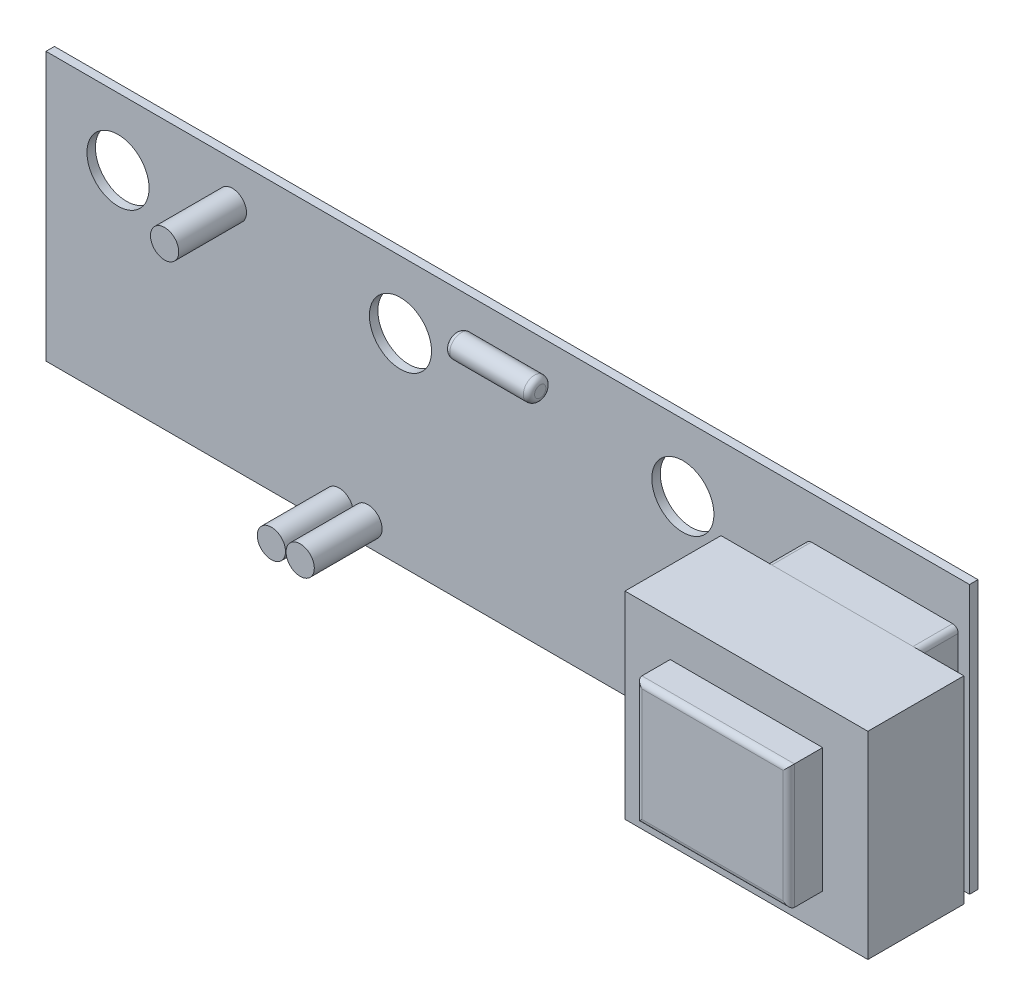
ISO-10303-21;
HEADER;
FILE_DESCRIPTION(('STEP AP214'),'2;1');
FILE_NAME('part.step','',(''),(''),'','','');
FILE_SCHEMA(('AUTOMOTIVE_DESIGN { 1 0 10303 214 1 1 1 1 }'));
ENDSEC;
DATA;
#1=APPLICATION_CONTEXT('core data for automotive mechanical design processes');
#2=APPLICATION_PROTOCOL_DEFINITION('international standard','automotive_design',2000,#1);
#3=PRODUCT_CONTEXT('',#1,'mechanical');
#4=PRODUCT('Part','Part','',(#3));
#5=PRODUCT_RELATED_PRODUCT_CATEGORY('part','',(#4));
#6=PRODUCT_DEFINITION_FORMATION('','',#4);
#7=PRODUCT_DEFINITION_CONTEXT('part definition',#1,'design');
#8=PRODUCT_DEFINITION('design','',#6,#7);
#9=PRODUCT_DEFINITION_SHAPE('','',#8);
#10=(LENGTH_UNIT() NAMED_UNIT(*) SI_UNIT(.MILLI.,.METRE.));
#11=(NAMED_UNIT(*) PLANE_ANGLE_UNIT() SI_UNIT($,.RADIAN.));
#12=(NAMED_UNIT(*) SI_UNIT($,.STERADIAN.) SOLID_ANGLE_UNIT());
#13=UNCERTAINTY_MEASURE_WITH_UNIT(LENGTH_MEASURE(1.E-05),#10,'distance_accuracy_value','');
#14=(GEOMETRIC_REPRESENTATION_CONTEXT(3) GLOBAL_UNCERTAINTY_ASSIGNED_CONTEXT((#13)) GLOBAL_UNIT_ASSIGNED_CONTEXT((#10,
#11,#12)) REPRESENTATION_CONTEXT('',''));
#15=CARTESIAN_POINT('',(0.,0.,0.));
#16=DIRECTION('',(0.,0.,1.));
#17=DIRECTION('',(1.,0.,0.));
#18=AXIS2_PLACEMENT_3D('',#15,#16,#17);
#19=CARTESIAN_POINT('',(70.,-5.75015964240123,3.));
#20=DIRECTION('',(-1.,0.,0.));
#21=DIRECTION('',(0.,0.,1.));
#22=AXIS2_PLACEMENT_3D('',#19,#20,#21);
#23=CYLINDRICAL_SURFACE('',#22,1.5);
#24=CARTESIAN_POINT('',(60.4,-5.75015964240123,3.));
#25=DIRECTION('',(1.,0.,0.));
#26=DIRECTION('',(0.,0.,-1.));
#27=AXIS2_PLACEMENT_3D('',#24,#25,#26);
#28=CIRCLE('',#27,1.5);
#29=CARTESIAN_POINT('',(60.4,-5.75015964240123,1.5));
#30=VERTEX_POINT('',#29);
#31=EDGE_CURVE('E50',#30,#30,#28,.T.);
#32=ORIENTED_EDGE('',*,*,#31,.T.);
#33=EDGE_LOOP('',(#32));
#34=FACE_BOUND('',#33,.T.);
#35=CARTESIAN_POINT('',(69.6,-5.75015964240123,3.));
#36=DIRECTION('',(1.,0.,0.));
#37=DIRECTION('',(0.,0.,-1.));
#38=AXIS2_PLACEMENT_3D('',#35,#36,#37);
#39=CIRCLE('',#38,1.5);
#40=CARTESIAN_POINT('',(69.6,-5.75015964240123,1.5));
#41=VERTEX_POINT('',#40);
#42=EDGE_CURVE('E54',#41,#41,#39,.F.);
#43=ORIENTED_EDGE('',*,*,#42,.T.);
#44=EDGE_LOOP('',(#43));
#45=FACE_BOUND('',#44,.T.);
#46=ADVANCED_FACE('F40',(#34,#45),#23,.T.);
#47=CARTESIAN_POINT('',(70.,-5.75015964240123,3.));
#48=DIRECTION('',(1.,0.,0.));
#49=DIRECTION('',(0.,0.,-1.));
#50=AXIS2_PLACEMENT_3D('',#47,#48,#49);
#51=PLANE('',#50);
#52=CARTESIAN_POINT('',(70.,-5.75015964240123,3.));
#53=DIRECTION('',(1.,0.,0.));
#54=DIRECTION('',(0.,0.,-1.));
#55=AXIS2_PLACEMENT_3D('',#52,#53,#54);
#56=CIRCLE('',#55,1.1);
#57=CARTESIAN_POINT('',(70.,-5.75015964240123,1.9));
#58=VERTEX_POINT('',#57);
#59=EDGE_CURVE('E11',#58,#58,#56,.T.);
#60=ORIENTED_EDGE('',*,*,#59,.T.);
#61=EDGE_LOOP('',(#60));
#62=FACE_BOUND('',#61,.T.);
#63=ADVANCED_FACE('F73',(#62),#51,.T.);
#64=CARTESIAN_POINT('',(60.,-5.75015964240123,3.));
#65=DIRECTION('',(1.,0.,0.));
#66=DIRECTION('',(0.,0.,-1.));
#67=AXIS2_PLACEMENT_3D('',#64,#65,#66);
#68=PLANE('',#67);
#69=CARTESIAN_POINT('',(60.,-5.75015964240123,3.));
#70=DIRECTION('',(1.,0.,0.));
#71=DIRECTION('',(0.,0.,-1.));
#72=AXIS2_PLACEMENT_3D('',#69,#70,#71);
#73=CIRCLE('',#72,1.1);
#74=CARTESIAN_POINT('',(60.,-5.75015964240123,1.9));
#75=VERTEX_POINT('',#74);
#76=EDGE_CURVE('E46',#75,#75,#73,.F.);
#77=ORIENTED_EDGE('',*,*,#76,.T.);
#78=EDGE_LOOP('',(#77));
#79=FACE_BOUND('',#78,.T.);
#80=ADVANCED_FACE('F69',(#79),#68,.F.);
#81=CARTESIAN_POINT('',(60.4,-5.75015964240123,3.));
#82=DIRECTION('',(1.,0.,0.));
#83=DIRECTION('',(0.,0.,-1.));
#84=AXIS2_PLACEMENT_3D('',#81,#82,#83);
#85=TOROIDAL_SURFACE('',#84,1.1,0.4);
#86=ORIENTED_EDGE('',*,*,#76,.F.);
#87=EDGE_LOOP('',(#86));
#88=FACE_BOUND('',#87,.T.);
#89=ORIENTED_EDGE('',*,*,#31,.F.);
#90=EDGE_LOOP('',(#89));
#91=FACE_BOUND('',#90,.T.);
#92=ADVANCED_FACE('F64',(#88,#91),#85,.T.);
#93=CARTESIAN_POINT('',(69.6,-5.75015964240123,3.));
#94=DIRECTION('',(1.,0.,0.));
#95=DIRECTION('',(0.,0.,-1.));
#96=AXIS2_PLACEMENT_3D('',#93,#94,#95);
#97=TOROIDAL_SURFACE('',#96,1.1,0.4);
#98=ORIENTED_EDGE('',*,*,#42,.F.);
#99=EDGE_LOOP('',(#98));
#100=FACE_BOUND('',#99,.T.);
#101=ORIENTED_EDGE('',*,*,#59,.F.);
#102=EDGE_LOOP('',(#101));
#103=FACE_BOUND('',#102,.T.);
#104=ADVANCED_FACE('F61',(#100,#103),#97,.T.);
#105=CLOSED_SHELL('',(#46,#63,#80,#92,#104));
#106=MANIFOLD_SOLID_BREP('B2',#105);
#107=CARTESIAN_POINT('',(35.,27.6151021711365,3.5));
#108=DIRECTION('',(-1.,0.,0.));
#109=DIRECTION('',(0.,0.,1.));
#110=AXIS2_PLACEMENT_3D('',#107,#108,#109);
#111=CYLINDRICAL_SURFACE('',#110,2.);
#112=CARTESIAN_POINT('',(21.,27.6151021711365,3.5));
#113=DIRECTION('',(1.,0.,0.));
#114=DIRECTION('',(0.,0.,-1.));
#115=AXIS2_PLACEMENT_3D('',#112,#113,#114);
#116=CIRCLE('',#115,2.);
#117=CARTESIAN_POINT('',(21.,27.6151021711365,1.5));
#118=VERTEX_POINT('',#117);
#119=EDGE_CURVE('E119',#118,#118,#116,.T.);
#120=ORIENTED_EDGE('',*,*,#119,.T.);
#121=EDGE_LOOP('',(#120));
#122=FACE_BOUND('',#121,.T.);
#123=CARTESIAN_POINT('',(34.,27.6151021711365,3.5));
#124=DIRECTION('',(1.,0.,0.));
#125=DIRECTION('',(0.,0.,-1.));
#126=AXIS2_PLACEMENT_3D('',#123,#124,#125);
#127=CIRCLE('',#126,2.);
#128=CARTESIAN_POINT('',(34.,27.6151021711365,1.5));
#129=VERTEX_POINT('',#128);
#130=EDGE_CURVE('E123',#129,#129,#127,.F.);
#131=ORIENTED_EDGE('',*,*,#130,.T.);
#132=EDGE_LOOP('',(#131));
#133=FACE_BOUND('',#132,.T.);
#134=ADVANCED_FACE('F109',(#122,#133),#111,.T.);
#135=CARTESIAN_POINT('',(35.,27.6151021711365,3.5));
#136=DIRECTION('',(1.,0.,0.));
#137=DIRECTION('',(0.,0.,-1.));
#138=AXIS2_PLACEMENT_3D('',#135,#136,#137);
#139=PLANE('',#138);
#140=CARTESIAN_POINT('',(35.,27.6151021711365,3.5));
#141=DIRECTION('',(1.,0.,0.));
#142=DIRECTION('',(0.,0.,-1.));
#143=AXIS2_PLACEMENT_3D('',#140,#141,#142);
#144=CIRCLE('',#143,1.);
#145=CARTESIAN_POINT('',(35.,27.6151021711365,2.5));
#146=VERTEX_POINT('',#145);
#147=EDGE_CURVE('E39',#146,#146,#144,.T.);
#148=ORIENTED_EDGE('',*,*,#147,.T.);
#149=EDGE_LOOP('',(#148));
#150=FACE_BOUND('',#149,.T.);
#151=ADVANCED_FACE('F142',(#150),#139,.T.);
#152=CARTESIAN_POINT('',(20.,27.6151021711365,3.5));
#153=DIRECTION('',(1.,0.,0.));
#154=DIRECTION('',(0.,0.,-1.));
#155=AXIS2_PLACEMENT_3D('',#152,#153,#154);
#156=PLANE('',#155);
#157=CARTESIAN_POINT('',(20.,27.6151021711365,3.5));
#158=DIRECTION('',(1.,0.,0.));
#159=DIRECTION('',(0.,0.,-1.));
#160=AXIS2_PLACEMENT_3D('',#157,#158,#159);
#161=CIRCLE('',#160,1.);
#162=CARTESIAN_POINT('',(20.,27.6151021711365,2.5));
#163=VERTEX_POINT('',#162);
#164=EDGE_CURVE('E115',#163,#163,#161,.F.);
#165=ORIENTED_EDGE('',*,*,#164,.T.);
#166=EDGE_LOOP('',(#165));
#167=FACE_BOUND('',#166,.T.);
#168=ADVANCED_FACE('F138',(#167),#156,.F.);
#169=CARTESIAN_POINT('',(21.,27.6151021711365,3.5));
#170=DIRECTION('',(1.,0.,0.));
#171=DIRECTION('',(0.,0.,-1.));
#172=AXIS2_PLACEMENT_3D('',#169,#170,#171);
#173=TOROIDAL_SURFACE('',#172,1.,1.);
#174=ORIENTED_EDGE('',*,*,#164,.F.);
#175=EDGE_LOOP('',(#174));
#176=FACE_BOUND('',#175,.T.);
#177=ORIENTED_EDGE('',*,*,#119,.F.);
#178=EDGE_LOOP('',(#177));
#179=FACE_BOUND('',#178,.T.);
#180=ADVANCED_FACE('F133',(#176,#179),#173,.T.);
#181=CARTESIAN_POINT('',(34.,27.6151021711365,3.5));
#182=DIRECTION('',(1.,0.,0.));
#183=DIRECTION('',(0.,0.,-1.));
#184=AXIS2_PLACEMENT_3D('',#181,#182,#183);
#185=TOROIDAL_SURFACE('',#184,1.,1.);
#186=ORIENTED_EDGE('',*,*,#130,.F.);
#187=EDGE_LOOP('',(#186));
#188=FACE_BOUND('',#187,.T.);
#189=ORIENTED_EDGE('',*,*,#147,.F.);
#190=EDGE_LOOP('',(#189));
#191=FACE_BOUND('',#190,.T.);
#192=ADVANCED_FACE('F130',(#188,#191),#185,.T.);
#193=CLOSED_SHELL('',(#134,#151,#168,#180,#192));
#194=MANIFOLD_SOLID_BREP('B6',#193);
#195=CARTESIAN_POINT('',(-21.5,27.,13.5));
#196=DIRECTION('',(0.,0.,-1.));
#197=DIRECTION('',(-1.,0.,0.));
#198=AXIS2_PLACEMENT_3D('',#195,#196,#197);
#199=CYLINDRICAL_SURFACE('',#198,2.5);
#200=CARTESIAN_POINT('',(-21.5,27.,13.5));
#201=DIRECTION('',(0.,0.,1.));
#202=DIRECTION('',(1.,0.,0.));
#203=AXIS2_PLACEMENT_3D('',#200,#201,#202);
#204=CIRCLE('',#203,2.5);
#205=CARTESIAN_POINT('',(-19.,27.,13.5));
#206=VERTEX_POINT('',#205);
#207=EDGE_CURVE('E108',#206,#206,#204,.T.);
#208=ORIENTED_EDGE('',*,*,#207,.F.);
#209=EDGE_LOOP('',(#208));
#210=FACE_BOUND('',#209,.T.);
#211=CARTESIAN_POINT('',(-21.5,27.,1.5));
#212=DIRECTION('',(0.,0.,1.));
#213=DIRECTION('',(1.,0.,0.));
#214=AXIS2_PLACEMENT_3D('',#211,#212,#213);
#215=CIRCLE('',#214,2.5);
#216=CARTESIAN_POINT('',(-19.,27.,1.5));
#217=VERTEX_POINT('',#216);
#218=EDGE_CURVE('E184',#217,#217,#215,.T.);
#219=ORIENTED_EDGE('',*,*,#218,.T.);
#220=EDGE_LOOP('',(#219));
#221=FACE_BOUND('',#220,.T.);
#222=ADVANCED_FACE('F178',(#210,#221),#199,.T.);
#223=CARTESIAN_POINT('',(-21.5,27.,13.5));
#224=DIRECTION('',(0.,0.,1.));
#225=DIRECTION('',(1.,0.,0.));
#226=AXIS2_PLACEMENT_3D('',#223,#224,#225);
#227=PLANE('',#226);
#228=ORIENTED_EDGE('',*,*,#207,.T.);
#229=EDGE_LOOP('',(#228));
#230=FACE_BOUND('',#229,.T.);
#231=ADVANCED_FACE('F193',(#230),#227,.T.);
#232=CARTESIAN_POINT('',(-21.5,27.,1.5));
#233=DIRECTION('',(0.,0.,1.));
#234=DIRECTION('',(1.,0.,0.));
#235=AXIS2_PLACEMENT_3D('',#232,#233,#234);
#236=PLANE('',#235);
#237=ORIENTED_EDGE('',*,*,#218,.F.);
#238=EDGE_LOOP('',(#237));
#239=FACE_BOUND('',#238,.T.);
#240=ADVANCED_FACE('F191',(#239),#236,.F.);
#241=CLOSED_SHELL('',(#222,#231,#240));
#242=MANIFOLD_SOLID_BREP('B34',#241);
#243=CARTESIAN_POINT('',(2.49999999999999,-9.49999999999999,13.5));
#244=DIRECTION('',(0.,0.,-1.));
#245=DIRECTION('',(-1.,0.,0.));
#246=AXIS2_PLACEMENT_3D('',#243,#244,#245);
#247=CYLINDRICAL_SURFACE('',#246,2.5);
#248=CARTESIAN_POINT('',(2.49999999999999,-9.49999999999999,13.5));
#249=DIRECTION('',(0.,0.,1.));
#250=DIRECTION('',(1.,0.,0.));
#251=AXIS2_PLACEMENT_3D('',#248,#249,#250);
#252=CIRCLE('',#251,2.5);
#253=CARTESIAN_POINT('',(4.99999999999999,-9.49999999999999,13.5));
#254=VERTEX_POINT('',#253);
#255=EDGE_CURVE('E177',#254,#254,#252,.T.);
#256=ORIENTED_EDGE('',*,*,#255,.F.);
#257=EDGE_LOOP('',(#256));
#258=FACE_BOUND('',#257,.T.);
#259=CARTESIAN_POINT('',(2.49999999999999,-9.5,1.50000000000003));
#260=DIRECTION('',(0.,0.,1.));
#261=DIRECTION('',(1.,0.,0.));
#262=AXIS2_PLACEMENT_3D('',#259,#260,#261);
#263=CIRCLE('',#262,2.5);
#264=CARTESIAN_POINT('',(4.99999999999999,-9.5,1.50000000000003));
#265=VERTEX_POINT('',#264);
#266=EDGE_CURVE('E227',#265,#265,#263,.T.);
#267=ORIENTED_EDGE('',*,*,#266,.T.);
#268=EDGE_LOOP('',(#267));
#269=FACE_BOUND('',#268,.T.);
#270=ADVANCED_FACE('F221',(#258,#269),#247,.T.);
#271=CARTESIAN_POINT('',(2.49999999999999,-9.49999999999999,13.5));
#272=DIRECTION('',(0.,0.,1.));
#273=DIRECTION('',(1.,0.,0.));
#274=AXIS2_PLACEMENT_3D('',#271,#272,#273);
#275=PLANE('',#274);
#276=ORIENTED_EDGE('',*,*,#255,.T.);
#277=EDGE_LOOP('',(#276));
#278=FACE_BOUND('',#277,.T.);
#279=ADVANCED_FACE('F236',(#278),#275,.T.);
#280=CARTESIAN_POINT('',(2.49999999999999,-9.5,1.50000000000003));
#281=DIRECTION('',(0.,0.,1.));
#282=DIRECTION('',(1.,0.,0.));
#283=AXIS2_PLACEMENT_3D('',#280,#281,#282);
#284=PLANE('',#283);
#285=ORIENTED_EDGE('',*,*,#266,.F.);
#286=EDGE_LOOP('',(#285));
#287=FACE_BOUND('',#286,.T.);
#288=ADVANCED_FACE('F234',(#287),#284,.F.);
#289=CLOSED_SHELL('',(#270,#279,#288));
#290=MANIFOLD_SOLID_BREP('B103',#289);
#291=CARTESIAN_POINT('',(-2.60000000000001,-9.49999999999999,13.5));
#292=DIRECTION('',(0.,0.,-1.));
#293=DIRECTION('',(-1.,0.,0.));
#294=AXIS2_PLACEMENT_3D('',#291,#292,#293);
#295=CYLINDRICAL_SURFACE('',#294,2.5);
#296=CARTESIAN_POINT('',(-2.60000000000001,-9.49999999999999,13.5));
#297=DIRECTION('',(0.,0.,1.));
#298=DIRECTION('',(1.,0.,0.));
#299=AXIS2_PLACEMENT_3D('',#296,#297,#298);
#300=CIRCLE('',#299,2.5);
#301=CARTESIAN_POINT('',(-0.100000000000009,-9.49999999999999,13.5));
#302=VERTEX_POINT('',#301);
#303=EDGE_CURVE('E220',#302,#302,#300,.T.);
#304=ORIENTED_EDGE('',*,*,#303,.F.);
#305=EDGE_LOOP('',(#304));
#306=FACE_BOUND('',#305,.T.);
#307=CARTESIAN_POINT('',(-2.60000000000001,-9.5,1.50000000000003));
#308=DIRECTION('',(0.,0.,1.));
#309=DIRECTION('',(1.,0.,0.));
#310=AXIS2_PLACEMENT_3D('',#307,#308,#309);
#311=CIRCLE('',#310,2.5);
#312=CARTESIAN_POINT('',(-0.100000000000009,-9.5,1.50000000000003));
#313=VERTEX_POINT('',#312);
#314=EDGE_CURVE('E272',#313,#313,#311,.T.);
#315=ORIENTED_EDGE('',*,*,#314,.T.);
#316=EDGE_LOOP('',(#315));
#317=FACE_BOUND('',#316,.T.);
#318=ADVANCED_FACE('F266',(#306,#317),#295,.T.);
#319=CARTESIAN_POINT('',(-2.60000000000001,-9.49999999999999,13.5));
#320=DIRECTION('',(0.,0.,1.));
#321=DIRECTION('',(1.,0.,0.));
#322=AXIS2_PLACEMENT_3D('',#319,#320,#321);
#323=PLANE('',#322);
#324=ORIENTED_EDGE('',*,*,#303,.T.);
#325=EDGE_LOOP('',(#324));
#326=FACE_BOUND('',#325,.T.);
#327=ADVANCED_FACE('F281',(#326),#323,.T.);
#328=CARTESIAN_POINT('',(-2.60000000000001,-9.5,1.50000000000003));
#329=DIRECTION('',(0.,0.,1.));
#330=DIRECTION('',(1.,0.,0.));
#331=AXIS2_PLACEMENT_3D('',#328,#329,#330);
#332=PLANE('',#331);
#333=ORIENTED_EDGE('',*,*,#314,.F.);
#334=EDGE_LOOP('',(#333));
#335=FACE_BOUND('',#334,.T.);
#336=ADVANCED_FACE('F279',(#335),#332,.F.);
#337=CLOSED_SHELL('',(#318,#327,#336));
#338=MANIFOLD_SOLID_BREP('B172',#337);
#339=CARTESIAN_POINT('',(80.,20.,31.5));
#340=DIRECTION('',(1.,0.,0.));
#341=DIRECTION('',(0.,0.,-1.));
#342=AXIS2_PLACEMENT_3D('',#339,#340,#341);
#343=PLANE('',#342);
#344=DIRECTION('',(0.,0.,-1.));
#345=VECTOR('',#344,1.);
#346=CARTESIAN_POINT('',(80.,-1.99999999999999,31.5));
#347=LINE('',#346,#345);
#348=CARTESIAN_POINT('',(80.,-1.99999999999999,30.5));
#349=VERTEX_POINT('',#348);
#350=CARTESIAN_POINT('',(80.,-1.99999999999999,25.5));
#351=VERTEX_POINT('',#350);
#352=EDGE_CURVE('E360',#349,#351,#347,.T.);
#353=ORIENTED_EDGE('',*,*,#352,.F.);
#354=DIRECTION('',(0.,-1.,0.));
#355=VECTOR('',#354,1.);
#356=CARTESIAN_POINT('',(80.,20.,30.5));
#357=LINE('',#356,#355);
#358=CARTESIAN_POINT('',(80.,20.,30.5));
#359=VERTEX_POINT('',#358);
#360=EDGE_CURVE('E264',#349,#359,#357,.F.);
#361=ORIENTED_EDGE('',*,*,#360,.T.);
#362=DIRECTION('',(0.,0.,-1.));
#363=VECTOR('',#362,1.);
#364=CARTESIAN_POINT('',(80.,20.,31.5));
#365=LINE('',#364,#363);
#366=CARTESIAN_POINT('',(80.,20.,25.5));
#367=VERTEX_POINT('',#366);
#368=EDGE_CURVE('E380',#359,#367,#365,.T.);
#369=ORIENTED_EDGE('',*,*,#368,.T.);
#370=DIRECTION('',(0.,-1.,0.));
#371=VECTOR('',#370,1.);
#372=CARTESIAN_POINT('',(80.,20.,25.5));
#373=LINE('',#372,#371);
#374=EDGE_CURVE('E375',#367,#351,#373,.T.);
#375=ORIENTED_EDGE('',*,*,#374,.T.);
#376=EDGE_LOOP('',(#353,#361,#369,#375));
#377=FACE_BOUND('',#376,.T.);
#378=ADVANCED_FACE('F311',(#377),#343,.F.);
#379=CARTESIAN_POINT('',(80.,-1.99999999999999,31.5));
#380=DIRECTION('',(0.,1.,0.));
#381=DIRECTION('',(0.,0.,1.));
#382=AXIS2_PLACEMENT_3D('',#379,#380,#381);
#383=PLANE('',#382);
#384=DIRECTION('',(0.,0.,-1.));
#385=VECTOR('',#384,1.);
#386=CARTESIAN_POINT('',(107.,-1.99999999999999,31.5));
#387=LINE('',#386,#385);
#388=CARTESIAN_POINT('',(107.,-1.99999999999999,30.5));
#389=VERTEX_POINT('',#388);
#390=CARTESIAN_POINT('',(107.,-1.99999999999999,25.5));
#391=VERTEX_POINT('',#390);
#392=EDGE_CURVE('E369',#389,#391,#387,.T.);
#393=ORIENTED_EDGE('',*,*,#392,.F.);
#394=DIRECTION('',(1.,0.,0.));
#395=VECTOR('',#394,1.);
#396=CARTESIAN_POINT('',(80.,-1.99999999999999,30.5));
#397=LINE('',#396,#395);
#398=EDGE_CURVE('E318',#389,#349,#397,.F.);
#399=ORIENTED_EDGE('',*,*,#398,.T.);
#400=ORIENTED_EDGE('',*,*,#352,.T.);
#401=DIRECTION('',(1.,0.,0.));
#402=VECTOR('',#401,1.);
#403=CARTESIAN_POINT('',(80.,-1.99999999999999,25.5));
#404=LINE('',#403,#402);
#405=EDGE_CURVE('E363',#351,#391,#404,.T.);
#406=ORIENTED_EDGE('',*,*,#405,.T.);
#407=EDGE_LOOP('',(#393,#399,#400,#406));
#408=FACE_BOUND('',#407,.T.);
#409=ADVANCED_FACE('F362',(#408),#383,.F.);
#410=CARTESIAN_POINT('',(107.,20.,31.5));
#411=DIRECTION('',(-1.,0.,0.));
#412=DIRECTION('',(0.,0.,1.));
#413=AXIS2_PLACEMENT_3D('',#410,#411,#412);
#414=PLANE('',#413);
#415=DIRECTION('',(0.,0.,-1.));
#416=VECTOR('',#415,1.);
#417=CARTESIAN_POINT('',(107.,20.,31.5));
#418=LINE('',#417,#416);
#419=CARTESIAN_POINT('',(107.,20.,30.5));
#420=VERTEX_POINT('',#419);
#421=CARTESIAN_POINT('',(107.,20.,25.5));
#422=VERTEX_POINT('',#421);
#423=EDGE_CURVE('E393',#420,#422,#418,.T.);
#424=ORIENTED_EDGE('',*,*,#423,.F.);
#425=DIRECTION('',(0.,1.,0.));
#426=VECTOR('',#425,1.);
#427=CARTESIAN_POINT('',(107.,-1.99999999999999,30.5));
#428=LINE('',#427,#426);
#429=EDGE_CURVE('E332',#420,#389,#428,.F.);
#430=ORIENTED_EDGE('',*,*,#429,.T.);
#431=ORIENTED_EDGE('',*,*,#392,.T.);
#432=DIRECTION('',(0.,1.,0.));
#433=VECTOR('',#432,1.);
#434=CARTESIAN_POINT('',(107.,20.,25.5));
#435=LINE('',#434,#433);
#436=EDGE_CURVE('E377',#391,#422,#435,.T.);
#437=ORIENTED_EDGE('',*,*,#436,.T.);
#438=EDGE_LOOP('',(#424,#430,#431,#437));
#439=FACE_BOUND('',#438,.T.);
#440=ADVANCED_FACE('F412',(#439),#414,.F.);
#441=CARTESIAN_POINT('',(80.,20.,31.5));
#442=DIRECTION('',(0.,-1.,0.));
#443=DIRECTION('',(0.,0.,-1.));
#444=AXIS2_PLACEMENT_3D('',#441,#442,#443);
#445=PLANE('',#444);
#446=ORIENTED_EDGE('',*,*,#368,.F.);
#447=DIRECTION('',(-1.,0.,0.));
#448=VECTOR('',#447,1.);
#449=CARTESIAN_POINT('',(107.,20.,30.5));
#450=LINE('',#449,#448);
#451=EDGE_CURVE('E404',#359,#420,#450,.F.);
#452=ORIENTED_EDGE('',*,*,#451,.T.);
#453=ORIENTED_EDGE('',*,*,#423,.T.);
#454=DIRECTION('',(-1.,0.,0.));
#455=VECTOR('',#454,1.);
#456=CARTESIAN_POINT('',(80.,20.,25.5));
#457=LINE('',#456,#455);
#458=EDGE_CURVE('E390',#422,#367,#457,.T.);
#459=ORIENTED_EDGE('',*,*,#458,.T.);
#460=EDGE_LOOP('',(#446,#452,#453,#459));
#461=FACE_BOUND('',#460,.T.);
#462=ADVANCED_FACE('F409',(#461),#445,.F.);
#463=CARTESIAN_POINT('',(80.,-1.99999999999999,31.5));
#464=DIRECTION('',(0.,0.,1.));
#465=DIRECTION('',(1.,0.,0.));
#466=AXIS2_PLACEMENT_3D('',#463,#464,#465);
#467=PLANE('',#466);
#468=DIRECTION('',(0.,1.,0.));
#469=VECTOR('',#468,1.);
#470=CARTESIAN_POINT('',(106.,20.,31.5));
#471=LINE('',#470,#469);
#472=CARTESIAN_POINT('',(106.,-0.99999999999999,31.5));
#473=VERTEX_POINT('',#472);
#474=CARTESIAN_POINT('',(106.,19.,31.5));
#475=VERTEX_POINT('',#474);
#476=EDGE_CURVE('E399',#473,#475,#471,.T.);
#477=ORIENTED_EDGE('',*,*,#476,.T.);
#478=DIRECTION('',(-1.,0.,0.));
#479=VECTOR('',#478,1.);
#480=CARTESIAN_POINT('',(80.,19.,31.5));
#481=LINE('',#480,#479);
#482=CARTESIAN_POINT('',(81.,19.,31.5));
#483=VERTEX_POINT('',#482);
#484=EDGE_CURVE('E401',#475,#483,#481,.T.);
#485=ORIENTED_EDGE('',*,*,#484,.T.);
#486=DIRECTION('',(0.,-1.,0.));
#487=VECTOR('',#486,1.);
#488=CARTESIAN_POINT('',(81.,-1.99999999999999,31.5));
#489=LINE('',#488,#487);
#490=CARTESIAN_POINT('',(81.,-0.99999999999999,31.5));
#491=VERTEX_POINT('',#490);
#492=EDGE_CURVE('E368',#483,#491,#489,.T.);
#493=ORIENTED_EDGE('',*,*,#492,.T.);
#494=DIRECTION('',(1.,0.,0.));
#495=VECTOR('',#494,1.);
#496=CARTESIAN_POINT('',(107.,-0.99999999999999,31.5));
#497=LINE('',#496,#495);
#498=EDGE_CURVE('E397',#491,#473,#497,.T.);
#499=ORIENTED_EDGE('',*,*,#498,.T.);
#500=EDGE_LOOP('',(#477,#485,#493,#499));
#501=FACE_BOUND('',#500,.T.);
#502=ADVANCED_FACE('F426',(#501),#467,.T.);
#503=CARTESIAN_POINT('',(80.,-1.99999999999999,25.5));
#504=DIRECTION('',(0.,0.,1.));
#505=DIRECTION('',(1.,0.,0.));
#506=AXIS2_PLACEMENT_3D('',#503,#504,#505);
#507=PLANE('',#506);
#508=ORIENTED_EDGE('',*,*,#374,.F.);
#509=ORIENTED_EDGE('',*,*,#458,.F.);
#510=ORIENTED_EDGE('',*,*,#436,.F.);
#511=ORIENTED_EDGE('',*,*,#405,.F.);
#512=EDGE_LOOP('',(#508,#509,#510,#511));
#513=FACE_BOUND('',#512,.T.);
#514=ADVANCED_FACE('F373',(#513),#507,.F.);
#515=CARTESIAN_POINT('',(80.,-0.999999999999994,30.5));
#516=DIRECTION('',(-1.,0.,0.));
#517=DIRECTION('',(0.,0.,1.));
#518=AXIS2_PLACEMENT_3D('',#515,#516,#517);
#519=CYLINDRICAL_SURFACE('',#518,1.);
#520=CARTESIAN_POINT('',(81.,-0.999999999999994,30.5));
#521=DIRECTION('',(-0.707106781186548,0.707106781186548,0.));
#522=DIRECTION('',(0.707106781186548,0.707106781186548,0.));
#523=AXIS2_PLACEMENT_3D('',#520,#521,#522);
#524=ELLIPSE('',#523,1.41421356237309,1.);
#525=EDGE_CURVE('E385',#349,#491,#524,.T.);
#526=ORIENTED_EDGE('',*,*,#525,.F.);
#527=ORIENTED_EDGE('',*,*,#398,.F.);
#528=CARTESIAN_POINT('',(106.,-0.999999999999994,30.5));
#529=DIRECTION('',(-0.707106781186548,-0.707106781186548,0.));
#530=DIRECTION('',(-0.707106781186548,0.707106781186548,0.));
#531=AXIS2_PLACEMENT_3D('',#528,#529,#530);
#532=ELLIPSE('',#531,1.41421356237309,1.);
#533=EDGE_CURVE('E382',#473,#389,#532,.F.);
#534=ORIENTED_EDGE('',*,*,#533,.F.);
#535=ORIENTED_EDGE('',*,*,#498,.F.);
#536=EDGE_LOOP('',(#526,#527,#534,#535));
#537=FACE_BOUND('',#536,.T.);
#538=ADVANCED_FACE('F415',(#537),#519,.T.);
#539=CARTESIAN_POINT('',(106.,-1.99999999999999,30.5));
#540=DIRECTION('',(0.,-1.,0.));
#541=DIRECTION('',(0.,0.,-1.));
#542=AXIS2_PLACEMENT_3D('',#539,#540,#541);
#543=CYLINDRICAL_SURFACE('',#542,1.);
#544=ORIENTED_EDGE('',*,*,#533,.T.);
#545=ORIENTED_EDGE('',*,*,#429,.F.);
#546=CARTESIAN_POINT('',(106.,19.,30.5));
#547=DIRECTION('',(0.707106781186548,-0.707106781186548,0.));
#548=DIRECTION('',(-0.707106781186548,-0.707106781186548,0.));
#549=AXIS2_PLACEMENT_3D('',#546,#547,#548);
#550=ELLIPSE('',#549,1.41421356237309,1.);
#551=EDGE_CURVE('E423',#475,#420,#550,.F.);
#552=ORIENTED_EDGE('',*,*,#551,.F.);
#553=ORIENTED_EDGE('',*,*,#476,.F.);
#554=EDGE_LOOP('',(#544,#545,#552,#553));
#555=FACE_BOUND('',#554,.T.);
#556=ADVANCED_FACE('F421',(#555),#543,.T.);
#557=CARTESIAN_POINT('',(81.,-1.99999999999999,30.5));
#558=DIRECTION('',(0.,1.,0.));
#559=DIRECTION('',(0.,0.,1.));
#560=AXIS2_PLACEMENT_3D('',#557,#558,#559);
#561=CYLINDRICAL_SURFACE('',#560,1.);
#562=ORIENTED_EDGE('',*,*,#525,.T.);
#563=ORIENTED_EDGE('',*,*,#492,.F.);
#564=CARTESIAN_POINT('',(81.,19.,30.5));
#565=DIRECTION('',(0.707106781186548,0.707106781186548,0.));
#566=DIRECTION('',(-0.707106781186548,0.707106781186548,0.));
#567=AXIS2_PLACEMENT_3D('',#564,#565,#566);
#568=ELLIPSE('',#567,1.41421356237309,1.);
#569=EDGE_CURVE('E430',#359,#483,#568,.T.);
#570=ORIENTED_EDGE('',*,*,#569,.F.);
#571=ORIENTED_EDGE('',*,*,#360,.F.);
#572=EDGE_LOOP('',(#562,#563,#570,#571));
#573=FACE_BOUND('',#572,.T.);
#574=ADVANCED_FACE('F429',(#573),#561,.T.);
#575=CARTESIAN_POINT('',(80.,19.,30.5));
#576=DIRECTION('',(1.,0.,0.));
#577=DIRECTION('',(0.,0.,-1.));
#578=AXIS2_PLACEMENT_3D('',#575,#576,#577);
#579=CYLINDRICAL_SURFACE('',#578,1.);
#580=ORIENTED_EDGE('',*,*,#551,.T.);
#581=ORIENTED_EDGE('',*,*,#451,.F.);
#582=ORIENTED_EDGE('',*,*,#569,.T.);
#583=ORIENTED_EDGE('',*,*,#484,.F.);
#584=EDGE_LOOP('',(#580,#581,#582,#583));
#585=FACE_BOUND('',#584,.T.);
#586=ADVANCED_FACE('F433',(#585),#579,.T.);
#587=CLOSED_SHELL('',(#378,#409,#440,#462,#502,#514,#538,#556,#574,#586));
#588=MANIFOLD_SOLID_BREP('B215',#587);
#589=CARTESIAN_POINT('',(72.,26.5,25.5));
#590=DIRECTION('',(1.,0.,0.));
#591=DIRECTION('',(0.,0.,-1.));
#592=AXIS2_PLACEMENT_3D('',#589,#590,#591);
#593=PLANE('',#592);
#594=DIRECTION('',(0.,-1.,0.));
#595=VECTOR('',#594,1.);
#596=CARTESIAN_POINT('',(72.,26.5,8.50000000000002));
#597=LINE('',#596,#595);
#598=CARTESIAN_POINT('',(72.,26.5,8.50000000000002));
#599=VERTEX_POINT('',#598);
#600=CARTESIAN_POINT('',(72.,-8.5,8.5));
#601=VERTEX_POINT('',#600);
#602=EDGE_CURVE('E548',#599,#601,#597,.T.);
#603=ORIENTED_EDGE('',*,*,#602,.T.);
#604=DIRECTION('',(0.,0.,-1.));
#605=VECTOR('',#604,1.);
#606=CARTESIAN_POINT('',(72.,-8.5,25.5));
#607=LINE('',#606,#605);
#608=CARTESIAN_POINT('',(72.,-8.5,25.5));
#609=VERTEX_POINT('',#608);
#610=EDGE_CURVE('E309',#609,#601,#607,.T.);
#611=ORIENTED_EDGE('',*,*,#610,.F.);
#612=DIRECTION('',(0.,-1.,0.));
#613=VECTOR('',#612,1.);
#614=CARTESIAN_POINT('',(72.,26.5,25.5));
#615=LINE('',#614,#613);
#616=CARTESIAN_POINT('',(72.,26.5,25.5));
#617=VERTEX_POINT('',#616);
#618=EDGE_CURVE('E566',#617,#609,#615,.T.);
#619=ORIENTED_EDGE('',*,*,#618,.F.);
#620=DIRECTION('',(0.,0.,-1.));
#621=VECTOR('',#620,1.);
#622=CARTESIAN_POINT('',(72.,26.5,25.5));
#623=LINE('',#622,#621);
#624=EDGE_CURVE('E560',#617,#599,#623,.T.);
#625=ORIENTED_EDGE('',*,*,#624,.T.);
#626=EDGE_LOOP('',(#603,#611,#619,#625));
#627=FACE_BOUND('',#626,.T.);
#628=ADVANCED_FACE('F504',(#627),#593,.F.);
#629=CARTESIAN_POINT('',(72.,-8.5,25.5));
#630=DIRECTION('',(0.,1.,0.));
#631=DIRECTION('',(-1.,0.,0.));
#632=AXIS2_PLACEMENT_3D('',#629,#630,#631);
#633=PLANE('',#632);
#634=DIRECTION('',(1.,0.,0.));
#635=VECTOR('',#634,1.);
#636=CARTESIAN_POINT('',(72.,-8.5,8.5));
#637=LINE('',#636,#635);
#638=CARTESIAN_POINT('',(115.,-8.5,8.5));
#639=VERTEX_POINT('',#638);
#640=EDGE_CURVE('E544',#601,#639,#637,.T.);
#641=ORIENTED_EDGE('',*,*,#640,.T.);
#642=DIRECTION('',(0.,0.,-1.));
#643=VECTOR('',#642,1.);
#644=CARTESIAN_POINT('',(115.,-8.5,25.5));
#645=LINE('',#644,#643);
#646=CARTESIAN_POINT('',(115.,-8.5,25.5));
#647=VERTEX_POINT('',#646);
#648=EDGE_CURVE('E511',#647,#639,#645,.T.);
#649=ORIENTED_EDGE('',*,*,#648,.F.);
#650=DIRECTION('',(1.,0.,0.));
#651=VECTOR('',#650,1.);
#652=CARTESIAN_POINT('',(72.,-8.5,25.5));
#653=LINE('',#652,#651);
#654=EDGE_CURVE('E556',#609,#647,#653,.T.);
#655=ORIENTED_EDGE('',*,*,#654,.F.);
#656=ORIENTED_EDGE('',*,*,#610,.T.);
#657=EDGE_LOOP('',(#641,#649,#655,#656));
#658=FACE_BOUND('',#657,.T.);
#659=ADVANCED_FACE('F555',(#658),#633,.F.);
#660=CARTESIAN_POINT('',(115.,26.5,25.5));
#661=DIRECTION('',(-1.,0.,0.));
#662=DIRECTION('',(0.,0.,1.));
#663=AXIS2_PLACEMENT_3D('',#660,#661,#662);
#664=PLANE('',#663);
#665=DIRECTION('',(0.,1.,0.));
#666=VECTOR('',#665,1.);
#667=CARTESIAN_POINT('',(115.,26.5,8.50000000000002));
#668=LINE('',#667,#666);
#669=CARTESIAN_POINT('',(115.,26.5,8.50000000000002));
#670=VERTEX_POINT('',#669);
#671=EDGE_CURVE('E549',#639,#670,#668,.T.);
#672=ORIENTED_EDGE('',*,*,#671,.T.);
#673=DIRECTION('',(0.,0.,-1.));
#674=VECTOR('',#673,1.);
#675=CARTESIAN_POINT('',(115.,26.5,25.5));
#676=LINE('',#675,#674);
#677=CARTESIAN_POINT('',(115.,26.5,25.5));
#678=VERTEX_POINT('',#677);
#679=EDGE_CURVE('E572',#678,#670,#676,.T.);
#680=ORIENTED_EDGE('',*,*,#679,.F.);
#681=DIRECTION('',(0.,1.,0.));
#682=VECTOR('',#681,1.);
#683=CARTESIAN_POINT('',(115.,26.5,25.5));
#684=LINE('',#683,#682);
#685=EDGE_CURVE('E523',#647,#678,#684,.T.);
#686=ORIENTED_EDGE('',*,*,#685,.F.);
#687=ORIENTED_EDGE('',*,*,#648,.T.);
#688=EDGE_LOOP('',(#672,#680,#686,#687));
#689=FACE_BOUND('',#688,.T.);
#690=ADVANCED_FACE('F575',(#689),#664,.F.);
#691=CARTESIAN_POINT('',(72.,26.5,25.5));
#692=DIRECTION('',(0.,-1.,0.));
#693=DIRECTION('',(1.,0.,0.));
#694=AXIS2_PLACEMENT_3D('',#691,#692,#693);
#695=PLANE('',#694);
#696=DIRECTION('',(-1.,0.,0.));
#697=VECTOR('',#696,1.);
#698=CARTESIAN_POINT('',(72.,26.5,8.50000000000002));
#699=LINE('',#698,#697);
#700=EDGE_CURVE('E564',#670,#599,#699,.T.);
#701=ORIENTED_EDGE('',*,*,#700,.T.);
#702=ORIENTED_EDGE('',*,*,#624,.F.);
#703=DIRECTION('',(-1.,0.,0.));
#704=VECTOR('',#703,1.);
#705=CARTESIAN_POINT('',(72.,26.5,25.5));
#706=LINE('',#705,#704);
#707=EDGE_CURVE('E518',#678,#617,#706,.T.);
#708=ORIENTED_EDGE('',*,*,#707,.F.);
#709=ORIENTED_EDGE('',*,*,#679,.T.);
#710=EDGE_LOOP('',(#701,#702,#708,#709));
#711=FACE_BOUND('',#710,.T.);
#712=ADVANCED_FACE('F577',(#711),#695,.F.);
#713=CARTESIAN_POINT('',(72.,-8.5,25.5));
#714=DIRECTION('',(0.,0.,1.));
#715=DIRECTION('',(1.,0.,0.));
#716=AXIS2_PLACEMENT_3D('',#713,#714,#715);
#717=PLANE('',#716);
#718=ORIENTED_EDGE('',*,*,#618,.T.);
#719=ORIENTED_EDGE('',*,*,#654,.T.);
#720=ORIENTED_EDGE('',*,*,#685,.T.);
#721=ORIENTED_EDGE('',*,*,#707,.T.);
#722=EDGE_LOOP('',(#718,#719,#720,#721));
#723=FACE_BOUND('',#722,.T.);
#724=ADVANCED_FACE('F578',(#723),#717,.T.);
#725=CARTESIAN_POINT('',(72.,-8.5,8.5));
#726=DIRECTION('',(0.,0.,1.));
#727=DIRECTION('',(1.,0.,0.));
#728=AXIS2_PLACEMENT_3D('',#725,#726,#727);
#729=PLANE('',#728);
#730=ORIENTED_EDGE('',*,*,#602,.F.);
#731=ORIENTED_EDGE('',*,*,#700,.F.);
#732=ORIENTED_EDGE('',*,*,#671,.F.);
#733=ORIENTED_EDGE('',*,*,#640,.F.);
#734=EDGE_LOOP('',(#730,#731,#732,#733));
#735=FACE_BOUND('',#734,.T.);
#736=ADVANCED_FACE('F545',(#735),#729,.F.);
#737=CLOSED_SHELL('',(#628,#659,#690,#712,#724,#736));
#738=MANIFOLD_SOLID_BREP('B258',#737);
#739=CARTESIAN_POINT('',(-54.5,-13.5,1.50000000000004));
#740=DIRECTION('',(0.,0.,1.));
#741=DIRECTION('',(1.,0.,0.));
#742=AXIS2_PLACEMENT_3D('',#739,#740,#741);
#743=PLANE('',#742);
#744=CARTESIAN_POINT('',(58.25,22.13,1.5));
#745=DIRECTION('',(0.,0.,1.));
#746=DIRECTION('',(1.,0.,0.));
#747=AXIS2_PLACEMENT_3D('',#744,#745,#746);
#748=CIRCLE('',#747,5.49999999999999);
#749=CARTESIAN_POINT('',(63.75,22.13,1.5));
#750=VERTEX_POINT('',#749);
#751=EDGE_CURVE('E815',#750,#750,#748,.T.);
#752=ORIENTED_EDGE('',*,*,#751,.F.);
#753=EDGE_LOOP('',(#752));
#754=FACE_BOUND('',#753,.T.);
#755=CARTESIAN_POINT('',(-41.75,22.13,1.5));
#756=DIRECTION('',(0.,0.,1.));
#757=DIRECTION('',(1.,0.,0.));
#758=AXIS2_PLACEMENT_3D('',#755,#756,#757);
#759=CIRCLE('',#758,5.5);
#760=CARTESIAN_POINT('',(-36.25,22.13,1.5));
#761=VERTEX_POINT('',#760);
#762=EDGE_CURVE('E729',#761,#761,#759,.T.);
#763=ORIENTED_EDGE('',*,*,#762,.F.);
#764=EDGE_LOOP('',(#763));
#765=FACE_BOUND('',#764,.T.);
#766=DIRECTION('',(0.,-1.,0.));
#767=VECTOR('',#766,1.);
#768=CARTESIAN_POINT('',(-54.5,34.,1.5));
#769=LINE('',#768,#767);
#770=CARTESIAN_POINT('',(-54.5,34.,1.5));
#771=VERTEX_POINT('',#770);
#772=CARTESIAN_POINT('',(-54.5,-13.5,1.50000000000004));
#773=VERTEX_POINT('',#772);
#774=EDGE_CURVE('E739',#771,#773,#769,.T.);
#775=ORIENTED_EDGE('',*,*,#774,.T.);
#776=DIRECTION('',(1.,0.,0.));
#777=VECTOR('',#776,1.);
#778=CARTESIAN_POINT('',(-54.5,-13.5,1.50000000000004));
#779=LINE('',#778,#777);
#780=CARTESIAN_POINT('',(109.,-13.5,1.5));
#781=VERTEX_POINT('',#780);
#782=EDGE_CURVE('E719',#773,#781,#779,.T.);
#783=ORIENTED_EDGE('',*,*,#782,.T.);
#784=DIRECTION('',(0.,1.,0.));
#785=VECTOR('',#784,1.);
#786=CARTESIAN_POINT('',(109.,34.,1.5));
#787=LINE('',#786,#785);
#788=CARTESIAN_POINT('',(109.,34.,1.5));
#789=VERTEX_POINT('',#788);
#790=EDGE_CURVE('E742',#781,#789,#787,.T.);
#791=ORIENTED_EDGE('',*,*,#790,.T.);
#792=DIRECTION('',(-1.,0.,0.));
#793=VECTOR('',#792,1.);
#794=CARTESIAN_POINT('',(-54.5,34.,1.5));
#795=LINE('',#794,#793);
#796=EDGE_CURVE('E744',#789,#771,#795,.T.);
#797=ORIENTED_EDGE('',*,*,#796,.T.);
#798=EDGE_LOOP('',(#775,#783,#791,#797));
#799=FACE_BOUND('',#798,.T.);
#800=CARTESIAN_POINT('',(8.24999999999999,22.13,1.5));
#801=DIRECTION('',(0.,0.,1.));
#802=DIRECTION('',(1.,0.,0.));
#803=AXIS2_PLACEMENT_3D('',#800,#801,#802);
#804=CIRCLE('',#803,5.5);
#805=CARTESIAN_POINT('',(13.75,22.13,1.5));
#806=VERTEX_POINT('',#805);
#807=EDGE_CURVE('E821',#806,#806,#804,.T.);
#808=ORIENTED_EDGE('',*,*,#807,.F.);
#809=EDGE_LOOP('',(#808));
#810=FACE_BOUND('',#809,.T.);
#811=DIRECTION('',(1.,0.,0.));
#812=VECTOR('',#811,1.);
#813=CARTESIAN_POINT('',(80.,-8.5,1.50000000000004));
#814=LINE('',#813,#812);
#815=CARTESIAN_POINT('',(81.,-8.5,1.50000000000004));
#816=VERTEX_POINT('',#815);
#817=CARTESIAN_POINT('',(106.,-8.5,1.50000000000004));
#818=VERTEX_POINT('',#817);
#819=EDGE_CURVE('E782',#816,#818,#814,.T.);
#820=ORIENTED_EDGE('',*,*,#819,.F.);
#821=CARTESIAN_POINT('',(81.,-7.5,1.50000000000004));
#822=DIRECTION('',(0.,0.,1.));
#823=DIRECTION('',(1.,0.,0.));
#824=AXIS2_PLACEMENT_3D('',#821,#822,#823);
#825=CIRCLE('',#824,1.);
#826=CARTESIAN_POINT('',(80.,-7.5,1.50000000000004));
#827=VERTEX_POINT('',#826);
#828=EDGE_CURVE('E777',#816,#827,#825,.F.);
#829=ORIENTED_EDGE('',*,*,#828,.T.);
#830=DIRECTION('',(0.,-1.,0.));
#831=VECTOR('',#830,1.);
#832=CARTESIAN_POINT('',(80.,26.5,1.5));
#833=LINE('',#832,#831);
#834=CARTESIAN_POINT('',(80.,25.5,1.5));
#835=VERTEX_POINT('',#834);
#836=EDGE_CURVE('E789',#835,#827,#833,.T.);
#837=ORIENTED_EDGE('',*,*,#836,.F.);
#838=CARTESIAN_POINT('',(81.,25.5,1.5));
#839=DIRECTION('',(0.,0.,1.));
#840=DIRECTION('',(1.,0.,0.));
#841=AXIS2_PLACEMENT_3D('',#838,#839,#840);
#842=CIRCLE('',#841,1.);
#843=CARTESIAN_POINT('',(81.,26.5,1.5));
#844=VERTEX_POINT('',#843);
#845=EDGE_CURVE('E779',#835,#844,#842,.F.);
#846=ORIENTED_EDGE('',*,*,#845,.T.);
#847=DIRECTION('',(-1.,0.,0.));
#848=VECTOR('',#847,1.);
#849=CARTESIAN_POINT('',(80.,26.5,1.5));
#850=LINE('',#849,#848);
#851=CARTESIAN_POINT('',(106.,26.5,1.5));
#852=VERTEX_POINT('',#851);
#853=EDGE_CURVE('E962',#852,#844,#850,.T.);
#854=ORIENTED_EDGE('',*,*,#853,.F.);
#855=CARTESIAN_POINT('',(106.,25.5,1.5));
#856=DIRECTION('',(0.,0.,1.));
#857=DIRECTION('',(1.,0.,0.));
#858=AXIS2_PLACEMENT_3D('',#855,#856,#857);
#859=CIRCLE('',#858,1.);
#860=CARTESIAN_POINT('',(107.,25.5,1.5));
#861=VERTEX_POINT('',#860);
#862=EDGE_CURVE('E502',#852,#861,#859,.F.);
#863=ORIENTED_EDGE('',*,*,#862,.T.);
#864=DIRECTION('',(0.,1.,0.));
#865=VECTOR('',#864,1.);
#866=CARTESIAN_POINT('',(107.,26.5,1.5));
#867=LINE('',#866,#865);
#868=CARTESIAN_POINT('',(107.,-7.5,1.50000000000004));
#869=VERTEX_POINT('',#868);
#870=EDGE_CURVE('E783',#869,#861,#867,.T.);
#871=ORIENTED_EDGE('',*,*,#870,.F.);
#872=CARTESIAN_POINT('',(106.,-7.5,1.50000000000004));
#873=DIRECTION('',(0.,0.,1.));
#874=DIRECTION('',(1.,0.,0.));
#875=AXIS2_PLACEMENT_3D('',#872,#873,#874);
#876=CIRCLE('',#875,1.);
#877=EDGE_CURVE('E624',#869,#818,#876,.F.);
#878=ORIENTED_EDGE('',*,*,#877,.T.);
#879=EDGE_LOOP('',(#820,#829,#837,#846,#854,#863,#871,#878));
#880=FACE_BOUND('',#879,.T.);
#881=ADVANCED_FACE('F616',(#754,#765,#799,#810,#880),#743,.T.);
#882=CARTESIAN_POINT('',(-54.5,-13.5,0.));
#883=DIRECTION('',(0.,0.,1.));
#884=DIRECTION('',(1.,0.,0.));
#885=AXIS2_PLACEMENT_3D('',#882,#883,#884);
#886=PLANE('',#885);
#887=CARTESIAN_POINT('',(8.24999999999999,22.13,0.));
#888=DIRECTION('',(0.,0.,1.));
#889=DIRECTION('',(1.,0.,0.));
#890=AXIS2_PLACEMENT_3D('',#887,#888,#889);
#891=CIRCLE('',#890,5.5);
#892=CARTESIAN_POINT('',(13.75,22.13,0.));
#893=VERTEX_POINT('',#892);
#894=EDGE_CURVE('E818',#893,#893,#891,.T.);
#895=ORIENTED_EDGE('',*,*,#894,.T.);
#896=EDGE_LOOP('',(#895));
#897=FACE_BOUND('',#896,.T.);
#898=DIRECTION('',(0.,-1.,0.));
#899=VECTOR('',#898,1.);
#900=CARTESIAN_POINT('',(-54.5,34.,0.));
#901=LINE('',#900,#899);
#902=CARTESIAN_POINT('',(-54.5,34.,0.));
#903=VERTEX_POINT('',#902);
#904=CARTESIAN_POINT('',(-54.5,-13.5,0.));
#905=VERTEX_POINT('',#904);
#906=EDGE_CURVE('E710',#903,#905,#901,.T.);
#907=ORIENTED_EDGE('',*,*,#906,.F.);
#908=DIRECTION('',(-1.,0.,0.));
#909=VECTOR('',#908,1.);
#910=CARTESIAN_POINT('',(-54.5,34.,0.));
#911=LINE('',#910,#909);
#912=CARTESIAN_POINT('',(109.,34.,0.));
#913=VERTEX_POINT('',#912);
#914=EDGE_CURVE('E737',#913,#903,#911,.T.);
#915=ORIENTED_EDGE('',*,*,#914,.F.);
#916=DIRECTION('',(0.,1.,0.));
#917=VECTOR('',#916,1.);
#918=CARTESIAN_POINT('',(109.,34.,0.));
#919=LINE('',#918,#917);
#920=CARTESIAN_POINT('',(109.,-13.5,0.));
#921=VERTEX_POINT('',#920);
#922=EDGE_CURVE('E711',#921,#913,#919,.T.);
#923=ORIENTED_EDGE('',*,*,#922,.F.);
#924=DIRECTION('',(1.,0.,0.));
#925=VECTOR('',#924,1.);
#926=CARTESIAN_POINT('',(-54.5,-13.5,0.));
#927=LINE('',#926,#925);
#928=EDGE_CURVE('E704',#905,#921,#927,.T.);
#929=ORIENTED_EDGE('',*,*,#928,.F.);
#930=EDGE_LOOP('',(#907,#915,#923,#929));
#931=FACE_BOUND('',#930,.T.);
#932=CARTESIAN_POINT('',(-41.75,22.13,0.));
#933=DIRECTION('',(0.,0.,1.));
#934=DIRECTION('',(1.,0.,0.));
#935=AXIS2_PLACEMENT_3D('',#932,#933,#934);
#936=CIRCLE('',#935,5.5);
#937=CARTESIAN_POINT('',(-36.25,22.13,0.));
#938=VERTEX_POINT('',#937);
#939=EDGE_CURVE('E732',#938,#938,#936,.T.);
#940=ORIENTED_EDGE('',*,*,#939,.T.);
#941=EDGE_LOOP('',(#940));
#942=FACE_BOUND('',#941,.T.);
#943=CARTESIAN_POINT('',(58.25,22.13,0.));
#944=DIRECTION('',(0.,0.,1.));
#945=DIRECTION('',(1.,0.,0.));
#946=AXIS2_PLACEMENT_3D('',#943,#944,#945);
#947=CIRCLE('',#946,5.49999999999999);
#948=CARTESIAN_POINT('',(63.75,22.13,0.));
#949=VERTEX_POINT('',#948);
#950=EDGE_CURVE('E807',#949,#949,#947,.T.);
#951=ORIENTED_EDGE('',*,*,#950,.T.);
#952=EDGE_LOOP('',(#951));
#953=FACE_BOUND('',#952,.T.);
#954=ADVANCED_FACE('F706',(#897,#931,#942,#953),#886,.F.);
#955=CARTESIAN_POINT('',(-54.5,34.,1.5));
#956=DIRECTION('',(1.,0.,0.));
#957=DIRECTION('',(0.,1.,0.));
#958=AXIS2_PLACEMENT_3D('',#955,#956,#957);
#959=PLANE('',#958);
#960=ORIENTED_EDGE('',*,*,#906,.T.);
#961=DIRECTION('',(0.,0.,-1.));
#962=VECTOR('',#961,1.);
#963=CARTESIAN_POINT('',(-54.5,-13.5,1.50000000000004));
#964=LINE('',#963,#962);
#965=EDGE_CURVE('E717',#773,#905,#964,.T.);
#966=ORIENTED_EDGE('',*,*,#965,.F.);
#967=ORIENTED_EDGE('',*,*,#774,.F.);
#968=DIRECTION('',(0.,0.,-1.));
#969=VECTOR('',#968,1.);
#970=CARTESIAN_POINT('',(-54.5,34.,1.5));
#971=LINE('',#970,#969);
#972=EDGE_CURVE('E728',#771,#903,#971,.T.);
#973=ORIENTED_EDGE('',*,*,#972,.T.);
#974=EDGE_LOOP('',(#960,#966,#967,#973));
#975=FACE_BOUND('',#974,.T.);
#976=ADVANCED_FACE('F618',(#975),#959,.F.);
#977=CARTESIAN_POINT('',(-54.5,-13.5,1.50000000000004));
#978=DIRECTION('',(0.,1.,0.));
#979=DIRECTION('',(-1.,0.,0.));
#980=AXIS2_PLACEMENT_3D('',#977,#978,#979);
#981=PLANE('',#980);
#982=ORIENTED_EDGE('',*,*,#928,.T.);
#983=DIRECTION('',(0.,0.,-1.));
#984=VECTOR('',#983,1.);
#985=CARTESIAN_POINT('',(109.,-13.5,1.5));
#986=LINE('',#985,#984);
#987=EDGE_CURVE('E724',#781,#921,#986,.T.);
#988=ORIENTED_EDGE('',*,*,#987,.F.);
#989=ORIENTED_EDGE('',*,*,#782,.F.);
#990=ORIENTED_EDGE('',*,*,#965,.T.);
#991=EDGE_LOOP('',(#982,#988,#989,#990));
#992=FACE_BOUND('',#991,.T.);
#993=ADVANCED_FACE('F718',(#992),#981,.F.);
#994=CARTESIAN_POINT('',(109.,34.,1.5));
#995=DIRECTION('',(-1.,0.,0.));
#996=DIRECTION('',(0.,0.,1.));
#997=AXIS2_PLACEMENT_3D('',#994,#995,#996);
#998=PLANE('',#997);
#999=ORIENTED_EDGE('',*,*,#922,.T.);
#1000=DIRECTION('',(0.,0.,-1.));
#1001=VECTOR('',#1000,1.);
#1002=CARTESIAN_POINT('',(109.,34.,1.5));
#1003=LINE('',#1002,#1001);
#1004=EDGE_CURVE('E747',#789,#913,#1003,.T.);
#1005=ORIENTED_EDGE('',*,*,#1004,.F.);
#1006=ORIENTED_EDGE('',*,*,#790,.F.);
#1007=ORIENTED_EDGE('',*,*,#987,.T.);
#1008=EDGE_LOOP('',(#999,#1005,#1006,#1007));
#1009=FACE_BOUND('',#1008,.T.);
#1010=ADVANCED_FACE('F840',(#1009),#998,.F.);
#1011=CARTESIAN_POINT('',(-54.5,34.,1.5));
#1012=DIRECTION('',(0.,-1.,0.));
#1013=DIRECTION('',(0.,0.,-1.));
#1014=AXIS2_PLACEMENT_3D('',#1011,#1012,#1013);
#1015=PLANE('',#1014);
#1016=ORIENTED_EDGE('',*,*,#914,.T.);
#1017=ORIENTED_EDGE('',*,*,#972,.F.);
#1018=ORIENTED_EDGE('',*,*,#796,.F.);
#1019=ORIENTED_EDGE('',*,*,#1004,.T.);
#1020=EDGE_LOOP('',(#1016,#1017,#1018,#1019));
#1021=FACE_BOUND('',#1020,.T.);
#1022=ADVANCED_FACE('F830',(#1021),#1015,.F.);
#1023=CARTESIAN_POINT('',(-41.75,22.13,1.5));
#1024=DIRECTION('',(0.,0.,-1.));
#1025=DIRECTION('',(-1.,0.,0.));
#1026=AXIS2_PLACEMENT_3D('',#1023,#1024,#1025);
#1027=CYLINDRICAL_SURFACE('',#1026,5.5);
#1028=ORIENTED_EDGE('',*,*,#762,.T.);
#1029=EDGE_LOOP('',(#1028));
#1030=FACE_BOUND('',#1029,.T.);
#1031=ORIENTED_EDGE('',*,*,#939,.F.);
#1032=EDGE_LOOP('',(#1031));
#1033=FACE_BOUND('',#1032,.T.);
#1034=ADVANCED_FACE('F827',(#1030,#1033),#1027,.F.);
#1035=CARTESIAN_POINT('',(8.24999999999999,22.13,1.5));
#1036=DIRECTION('',(0.,0.,-1.));
#1037=DIRECTION('',(-1.,0.,0.));
#1038=AXIS2_PLACEMENT_3D('',#1035,#1036,#1037);
#1039=CYLINDRICAL_SURFACE('',#1038,5.5);
#1040=ORIENTED_EDGE('',*,*,#807,.T.);
#1041=EDGE_LOOP('',(#1040));
#1042=FACE_BOUND('',#1041,.T.);
#1043=ORIENTED_EDGE('',*,*,#894,.F.);
#1044=EDGE_LOOP('',(#1043));
#1045=FACE_BOUND('',#1044,.T.);
#1046=ADVANCED_FACE('F829',(#1042,#1045),#1039,.F.);
#1047=CARTESIAN_POINT('',(58.25,22.13,1.5));
#1048=DIRECTION('',(0.,0.,-1.));
#1049=DIRECTION('',(-1.,0.,0.));
#1050=AXIS2_PLACEMENT_3D('',#1047,#1048,#1049);
#1051=CYLINDRICAL_SURFACE('',#1050,5.49999999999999);
#1052=ORIENTED_EDGE('',*,*,#751,.T.);
#1053=EDGE_LOOP('',(#1052));
#1054=FACE_BOUND('',#1053,.T.);
#1055=ORIENTED_EDGE('',*,*,#950,.F.);
#1056=EDGE_LOOP('',(#1055));
#1057=FACE_BOUND('',#1056,.T.);
#1058=ADVANCED_FACE('F837',(#1054,#1057),#1051,.F.);
#1059=CARTESIAN_POINT('',(80.,26.5,8.50000000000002));
#1060=DIRECTION('',(1.,0.,0.));
#1061=DIRECTION('',(0.,0.,-1.));
#1062=AXIS2_PLACEMENT_3D('',#1059,#1060,#1061);
#1063=PLANE('',#1062);
#1064=ORIENTED_EDGE('',*,*,#836,.T.);
#1065=DIRECTION('',(0.,0.,-1.));
#1066=VECTOR('',#1065,1.);
#1067=CARTESIAN_POINT('',(80.,-7.5,8.5));
#1068=LINE('',#1067,#1066);
#1069=CARTESIAN_POINT('',(80.,-7.5,8.5));
#1070=VERTEX_POINT('',#1069);
#1071=EDGE_CURVE('E758',#827,#1070,#1068,.F.);
#1072=ORIENTED_EDGE('',*,*,#1071,.T.);
#1073=DIRECTION('',(0.,-1.,0.));
#1074=VECTOR('',#1073,1.);
#1075=CARTESIAN_POINT('',(80.,26.5,8.50000000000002));
#1076=LINE('',#1075,#1074);
#1077=CARTESIAN_POINT('',(80.,25.5,8.50000000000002));
#1078=VERTEX_POINT('',#1077);
#1079=EDGE_CURVE('E809',#1078,#1070,#1076,.T.);
#1080=ORIENTED_EDGE('',*,*,#1079,.F.);
#1081=DIRECTION('',(0.,0.,-1.));
#1082=VECTOR('',#1081,1.);
#1083=CARTESIAN_POINT('',(80.,25.5,8.50000000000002));
#1084=LINE('',#1083,#1082);
#1085=EDGE_CURVE('E755',#1078,#835,#1084,.T.);
#1086=ORIENTED_EDGE('',*,*,#1085,.T.);
#1087=EDGE_LOOP('',(#1064,#1072,#1080,#1086));
#1088=FACE_BOUND('',#1087,.T.);
#1089=ADVANCED_FACE('F888',(#1088),#1063,.F.);
#1090=CARTESIAN_POINT('',(80.,-8.5,8.5));
#1091=DIRECTION('',(0.,1.,0.));
#1092=DIRECTION('',(0.,0.,1.));
#1093=AXIS2_PLACEMENT_3D('',#1090,#1091,#1092);
#1094=PLANE('',#1093);
#1095=DIRECTION('',(1.,0.,0.));
#1096=VECTOR('',#1095,1.);
#1097=CARTESIAN_POINT('',(80.,-8.5,8.5));
#1098=LINE('',#1097,#1096);
#1099=CARTESIAN_POINT('',(81.,-8.5,8.5));
#1100=VERTEX_POINT('',#1099);
#1101=CARTESIAN_POINT('',(106.,-8.5,8.5));
#1102=VERTEX_POINT('',#1101);
#1103=EDGE_CURVE('E800',#1100,#1102,#1098,.T.);
#1104=ORIENTED_EDGE('',*,*,#1103,.F.);
#1105=DIRECTION('',(0.,0.,-1.));
#1106=VECTOR('',#1105,1.);
#1107=CARTESIAN_POINT('',(81.,-8.5,8.5));
#1108=LINE('',#1107,#1106);
#1109=EDGE_CURVE('E752',#1100,#816,#1108,.T.);
#1110=ORIENTED_EDGE('',*,*,#1109,.T.);
#1111=ORIENTED_EDGE('',*,*,#819,.T.);
#1112=DIRECTION('',(0.,0.,-1.));
#1113=VECTOR('',#1112,1.);
#1114=CARTESIAN_POINT('',(106.,-8.5,8.5));
#1115=LINE('',#1114,#1113);
#1116=EDGE_CURVE('E723',#818,#1102,#1115,.F.);
#1117=ORIENTED_EDGE('',*,*,#1116,.T.);
#1118=EDGE_LOOP('',(#1104,#1110,#1111,#1117));
#1119=FACE_BOUND('',#1118,.T.);
#1120=ADVANCED_FACE('F786',(#1119),#1094,.F.);
#1121=CARTESIAN_POINT('',(107.,26.5,8.50000000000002));
#1122=DIRECTION('',(-1.,0.,0.));
#1123=DIRECTION('',(0.,-1.,0.));
#1124=AXIS2_PLACEMENT_3D('',#1121,#1122,#1123);
#1125=PLANE('',#1124);
#1126=DIRECTION('',(0.,1.,0.));
#1127=VECTOR('',#1126,1.);
#1128=CARTESIAN_POINT('',(107.,26.5,8.50000000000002));
#1129=LINE('',#1128,#1127);
#1130=CARTESIAN_POINT('',(107.,-7.5,8.5));
#1131=VERTEX_POINT('',#1130);
#1132=CARTESIAN_POINT('',(107.,25.5,8.50000000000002));
#1133=VERTEX_POINT('',#1132);
#1134=EDGE_CURVE('E798',#1131,#1133,#1129,.T.);
#1135=ORIENTED_EDGE('',*,*,#1134,.F.);
#1136=DIRECTION('',(0.,0.,-1.));
#1137=VECTOR('',#1136,1.);
#1138=CARTESIAN_POINT('',(107.,-7.5,8.5));
#1139=LINE('',#1138,#1137);
#1140=EDGE_CURVE('E775',#1131,#869,#1139,.T.);
#1141=ORIENTED_EDGE('',*,*,#1140,.T.);
#1142=ORIENTED_EDGE('',*,*,#870,.T.);
#1143=DIRECTION('',(0.,0.,-1.));
#1144=VECTOR('',#1143,1.);
#1145=CARTESIAN_POINT('',(107.,25.5,8.50000000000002));
#1146=LINE('',#1145,#1144);
#1147=EDGE_CURVE('E773',#861,#1133,#1146,.F.);
#1148=ORIENTED_EDGE('',*,*,#1147,.T.);
#1149=EDGE_LOOP('',(#1135,#1141,#1142,#1148));
#1150=FACE_BOUND('',#1149,.T.);
#1151=ADVANCED_FACE('F802',(#1150),#1125,.F.);
#1152=CARTESIAN_POINT('',(80.,26.5,8.50000000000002));
#1153=DIRECTION('',(0.,-1.,0.));
#1154=DIRECTION('',(0.,0.,-1.));
#1155=AXIS2_PLACEMENT_3D('',#1152,#1153,#1154);
#1156=PLANE('',#1155);
#1157=ORIENTED_EDGE('',*,*,#853,.T.);
#1158=DIRECTION('',(0.,0.,-1.));
#1159=VECTOR('',#1158,1.);
#1160=CARTESIAN_POINT('',(81.,26.5,8.50000000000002));
#1161=LINE('',#1160,#1159);
#1162=CARTESIAN_POINT('',(81.,26.5,8.50000000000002));
#1163=VERTEX_POINT('',#1162);
#1164=EDGE_CURVE('E771',#844,#1163,#1161,.F.);
#1165=ORIENTED_EDGE('',*,*,#1164,.T.);
#1166=DIRECTION('',(-1.,0.,0.));
#1167=VECTOR('',#1166,1.);
#1168=CARTESIAN_POINT('',(80.,26.5,8.50000000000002));
#1169=LINE('',#1168,#1167);
#1170=CARTESIAN_POINT('',(106.,26.5,8.50000000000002));
#1171=VERTEX_POINT('',#1170);
#1172=EDGE_CURVE('E804',#1171,#1163,#1169,.T.);
#1173=ORIENTED_EDGE('',*,*,#1172,.F.);
#1174=DIRECTION('',(0.,0.,-1.));
#1175=VECTOR('',#1174,1.);
#1176=CARTESIAN_POINT('',(106.,26.5,8.50000000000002));
#1177=LINE('',#1176,#1175);
#1178=EDGE_CURVE('E768',#1171,#852,#1177,.T.);
#1179=ORIENTED_EDGE('',*,*,#1178,.T.);
#1180=EDGE_LOOP('',(#1157,#1165,#1173,#1179));
#1181=FACE_BOUND('',#1180,.T.);
#1182=ADVANCED_FACE('F912',(#1181),#1156,.F.);
#1183=CARTESIAN_POINT('',(80.,-8.5,8.5));
#1184=DIRECTION('',(0.,0.,1.));
#1185=DIRECTION('',(1.,0.,0.));
#1186=AXIS2_PLACEMENT_3D('',#1183,#1184,#1185);
#1187=PLANE('',#1186);
#1188=ORIENTED_EDGE('',*,*,#1079,.T.);
#1189=CARTESIAN_POINT('',(81.,-7.5,8.5));
#1190=DIRECTION('',(0.,0.,1.));
#1191=DIRECTION('',(1.,0.,0.));
#1192=AXIS2_PLACEMENT_3D('',#1189,#1190,#1191);
#1193=CIRCLE('',#1192,1.);
#1194=EDGE_CURVE('E766',#1070,#1100,#1193,.T.);
#1195=ORIENTED_EDGE('',*,*,#1194,.T.);
#1196=ORIENTED_EDGE('',*,*,#1103,.T.);
#1197=CARTESIAN_POINT('',(106.,-7.5,8.5));
#1198=DIRECTION('',(0.,0.,1.));
#1199=DIRECTION('',(1.,0.,0.));
#1200=AXIS2_PLACEMENT_3D('',#1197,#1198,#1199);
#1201=CIRCLE('',#1200,1.);
#1202=EDGE_CURVE('E762',#1102,#1131,#1201,.T.);
#1203=ORIENTED_EDGE('',*,*,#1202,.T.);
#1204=ORIENTED_EDGE('',*,*,#1134,.T.);
#1205=CARTESIAN_POINT('',(106.,25.5,8.50000000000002));
#1206=DIRECTION('',(0.,0.,1.));
#1207=DIRECTION('',(1.,0.,0.));
#1208=AXIS2_PLACEMENT_3D('',#1205,#1206,#1207);
#1209=CIRCLE('',#1208,1.);
#1210=EDGE_CURVE('E760',#1133,#1171,#1209,.T.);
#1211=ORIENTED_EDGE('',*,*,#1210,.T.);
#1212=ORIENTED_EDGE('',*,*,#1172,.T.);
#1213=CARTESIAN_POINT('',(81.,25.5,8.50000000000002));
#1214=DIRECTION('',(0.,0.,1.));
#1215=DIRECTION('',(1.,0.,0.));
#1216=AXIS2_PLACEMENT_3D('',#1213,#1214,#1215);
#1217=CIRCLE('',#1216,1.);
#1218=EDGE_CURVE('E764',#1163,#1078,#1217,.T.);
#1219=ORIENTED_EDGE('',*,*,#1218,.T.);
#1220=EDGE_LOOP('',(#1188,#1195,#1196,#1203,#1204,#1211,#1212,#1219));
#1221=FACE_BOUND('',#1220,.T.);
#1222=ADVANCED_FACE('F797',(#1221),#1187,.T.);
#1223=CARTESIAN_POINT('',(81.,-7.5,8.5));
#1224=DIRECTION('',(0.,0.,-1.));
#1225=DIRECTION('',(-1.,0.,0.));
#1226=AXIS2_PLACEMENT_3D('',#1223,#1224,#1225);
#1227=CYLINDRICAL_SURFACE('',#1226,1.);
#1228=ORIENTED_EDGE('',*,*,#1194,.F.);
#1229=ORIENTED_EDGE('',*,*,#1071,.F.);
#1230=ORIENTED_EDGE('',*,*,#828,.F.);
#1231=ORIENTED_EDGE('',*,*,#1109,.F.);
#1232=EDGE_LOOP('',(#1228,#1229,#1230,#1231));
#1233=FACE_BOUND('',#1232,.T.);
#1234=ADVANCED_FACE('F926',(#1233),#1227,.T.);
#1235=CARTESIAN_POINT('',(81.,25.5,8.50000000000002));
#1236=DIRECTION('',(0.,0.,-1.));
#1237=DIRECTION('',(-1.,0.,0.));
#1238=AXIS2_PLACEMENT_3D('',#1235,#1236,#1237);
#1239=CYLINDRICAL_SURFACE('',#1238,1.);
#1240=ORIENTED_EDGE('',*,*,#1218,.F.);
#1241=ORIENTED_EDGE('',*,*,#1164,.F.);
#1242=ORIENTED_EDGE('',*,*,#845,.F.);
#1243=ORIENTED_EDGE('',*,*,#1085,.F.);
#1244=EDGE_LOOP('',(#1240,#1241,#1242,#1243));
#1245=FACE_BOUND('',#1244,.T.);
#1246=ADVANCED_FACE('F933',(#1245),#1239,.T.);
#1247=CARTESIAN_POINT('',(106.,-7.5,8.5));
#1248=DIRECTION('',(0.,0.,-1.));
#1249=DIRECTION('',(-1.,0.,0.));
#1250=AXIS2_PLACEMENT_3D('',#1247,#1248,#1249);
#1251=CYLINDRICAL_SURFACE('',#1250,1.);
#1252=ORIENTED_EDGE('',*,*,#1202,.F.);
#1253=ORIENTED_EDGE('',*,*,#1116,.F.);
#1254=ORIENTED_EDGE('',*,*,#877,.F.);
#1255=ORIENTED_EDGE('',*,*,#1140,.F.);
#1256=EDGE_LOOP('',(#1252,#1253,#1254,#1255));
#1257=FACE_BOUND('',#1256,.T.);
#1258=ADVANCED_FACE('F792',(#1257),#1251,.T.);
#1259=CARTESIAN_POINT('',(106.,25.5,8.50000000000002));
#1260=DIRECTION('',(0.,0.,-1.));
#1261=DIRECTION('',(-1.,0.,0.));
#1262=AXIS2_PLACEMENT_3D('',#1259,#1260,#1261);
#1263=CYLINDRICAL_SURFACE('',#1262,1.);
#1264=ORIENTED_EDGE('',*,*,#1210,.F.);
#1265=ORIENTED_EDGE('',*,*,#1147,.F.);
#1266=ORIENTED_EDGE('',*,*,#862,.F.);
#1267=ORIENTED_EDGE('',*,*,#1178,.F.);
#1268=EDGE_LOOP('',(#1264,#1265,#1266,#1267));
#1269=FACE_BOUND('',#1268,.T.);
#1270=ADVANCED_FACE('F948',(#1269),#1263,.T.);
#1271=CLOSED_SHELL('',(#881,#954,#976,#993,#1010,#1022,#1034,#1046,#1058,#1089,#1120,#1151,
#1182,#1222,#1234,#1246,#1258,#1270));
#1272=MANIFOLD_SOLID_BREP('B303',#1271);
#1273=ADVANCED_BREP_SHAPE_REPRESENTATION('',(#18,#106,#194,#242,#290,#338,#588,#738,#1272),#14);
#1274=SHAPE_DEFINITION_REPRESENTATION(#9,#1273);
ENDSEC;
END-ISO-10303-21;
